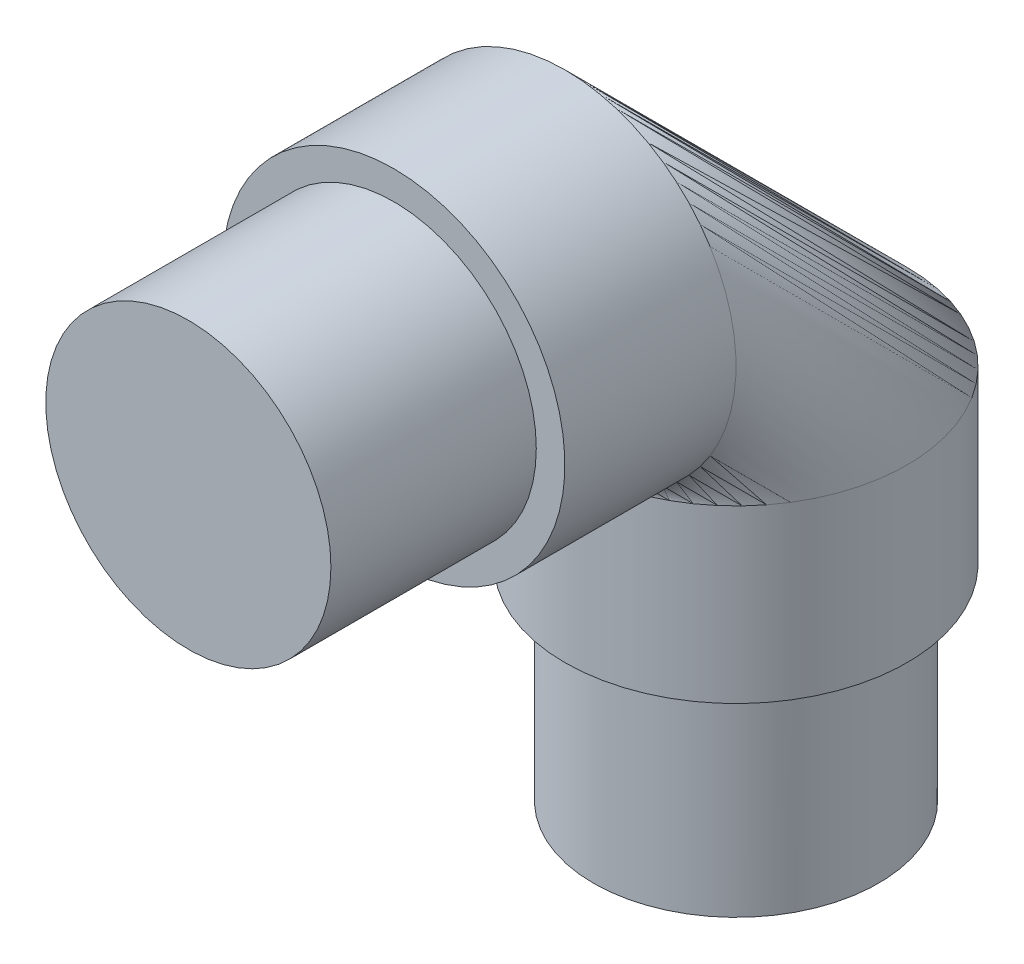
from build123d import *

# Parameters (mm, degrees)
SKETCH_1_R        = 8.33
EXTRUDE_1_DEPTH   = 12
SWEEP_1_PROFILE_R = 10
SKETCH_15_R       = 8.33
EXTRUDE_2_DEPTH   = 12


with BuildPart() as part:
    # Sketch 1 → Extrude 1 (new body)
    with BuildSketch(Plane.XY):
        Circle(SKETCH_1_R)
    extrude(amount=EXTRUDE_1_DEPTH)

    # Sweep 1: sweep along a path in Sketch 2
    with BuildLine(Plane(origin=(0, 0, 0), x_dir=(0, 0, -1), z_dir=(1, 0, 0))) as sweep_1_path:
        Line((0, 0), (10, 0))
        ThreePointArc((10, 0), (17.071067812, -2.928932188), (20, -10))
        Line((20, -10), (20, -20))
    # Sweep 1 profile (on start of the path) → Sweep 1 (sweep)
    with BuildSketch(Plane(origin=(0, 0, 0), x_dir=(-1, 0, 0), z_dir=(0, 0, -1))):
        Circle(SWEEP_1_PROFILE_R)
    sweep(path=sweep_1_path.line)

    # Sketch 15 → Extrude 2 (add)
    with BuildSketch(Plane.XZ.offset(20)):
        with Locations(Location((0, -20, 0), (0, 0, 90))):
            Circle(SKETCH_15_R)
    extrude(amount=EXTRUDE_2_DEPTH)


solid = part.part
